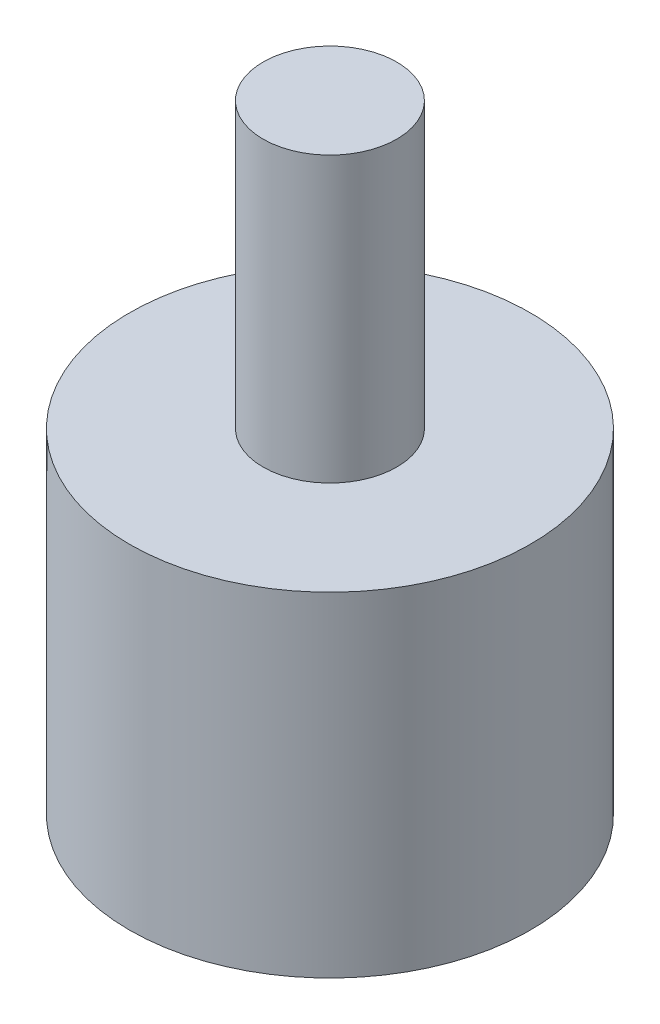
from build123d import *

# Parameters (mm, degrees)
SKETCH_1_R      = 12
EXTRUDE_1_DEPTH = 20
SKETCH_2_R      = 4
EXTRUDE_2_DEPTH = 17


with BuildPart() as part:
    # Sketch 1 → Extrude 1 (new body)
    with BuildSketch(Plane(origin=(0, 0, 0), x_dir=(1, 0, 0), z_dir=(0, 1, 0))):
        with Locations(Location((0, 0, 0), (0, 0, 270))):
            Circle(SKETCH_1_R)
    extrude(amount=EXTRUDE_1_DEPTH)

    # Sketch 2 → Extrude 2 (add)
    with BuildSketch(Plane(origin=(0, 20, 0), x_dir=(1, 0, 0), z_dir=(0, 1, 0))):
        with Locations(Location((0, 0, 0), (0, 0, 270))):
            Circle(SKETCH_2_R)
    extrude(amount=EXTRUDE_2_DEPTH)


solid = part.part
